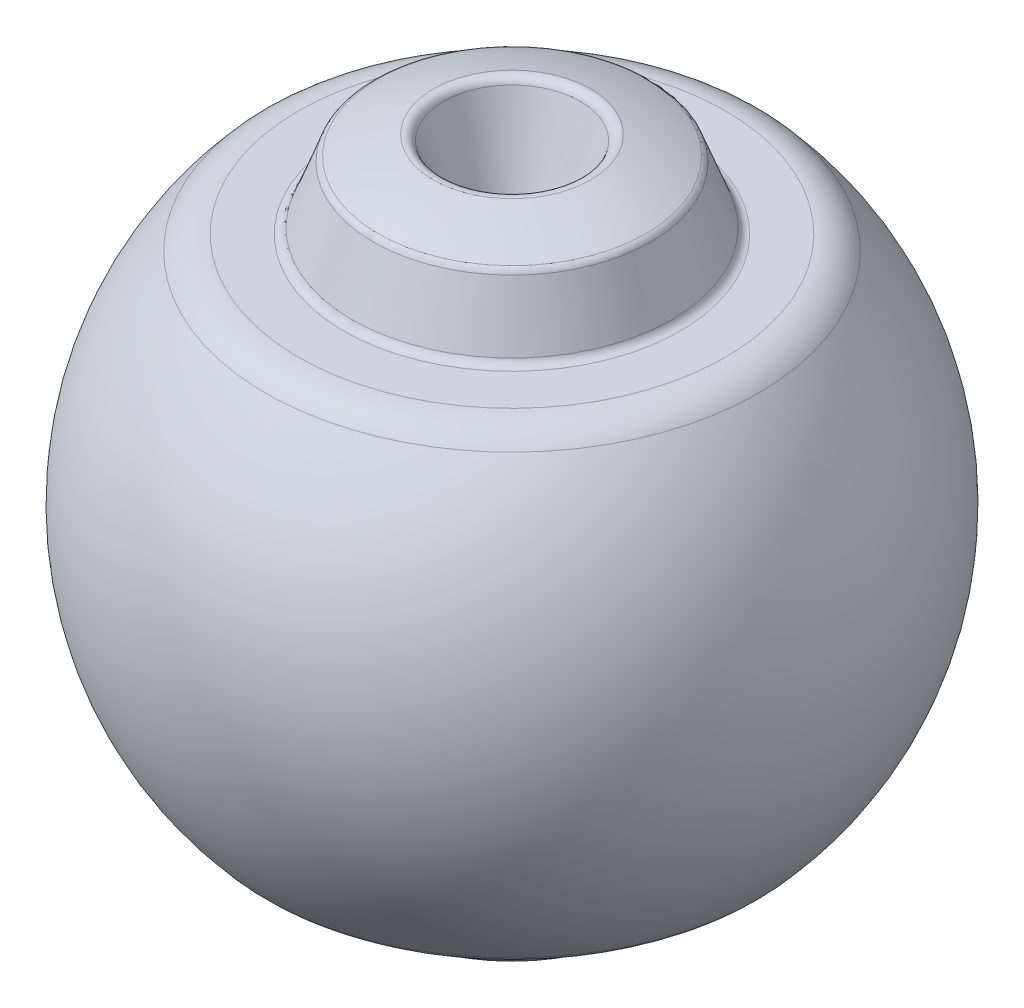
from build123d import *

# Parameters (mm, degrees)
FILLET1_R = 1
FILLET2_R = 5


with BuildPart() as part:
    # Sketch1 → Revolve1 (revolve)
    with BuildSketch(Plane.XY):
        with BuildLine():
            ThreePointArc((26.438477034, 26.594302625), (37.5, 0), (26.438477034, -26.594302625))
            Line((26.438477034, -26.594302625), (18.438477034, -26.594302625))
            Line((18.438477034, -26.594302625), (15.632766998, -34.08616429))
            ThreePointArc((15.632766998, -34.08616429), (11.926184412, -35.553004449), (8.084838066, -36.618101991))
            Line((8.084838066, -36.618101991), (4.436473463, -26.594302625))
            Line((4.436473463, -26.594302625), (0, -26.594302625))
            Line((0, -26.594302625), (0, 26.594302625))
            Line((0, 26.594302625), (4.436473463, 26.594302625))
            Line((4.436473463, 26.594302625), (8.084838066, 36.618101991))
            ThreePointArc((8.084838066, 36.618101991), (11.926184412, 35.553004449), (15.632766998, 34.08616429))
            Line((15.632766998, 34.08616429), (18.438477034, 26.594302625))
            Line((18.438477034, 26.594302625), (26.438477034, 26.594302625))
        make_face()
    revolve(axis=Axis((0, 26.594302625, 0), (0, -1, 0)))

    # Fillet1
    fillet1_edges = [part.edges().sort_by_distance(p)[0] for p in [
        (-18.438477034, -26.594302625, 0),
        (-15.632766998, -34.08616429, 0),
        (-8.084838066, -36.618101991, 0),
        (-4.436473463, -26.594302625, 0),
        (-4.436473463, 26.594302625, 0),
        (-8.084838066, 36.618101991, 0),
        (-15.632766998, 34.08616429, 0),
        (-18.438477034, 26.594302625, 0),
    ]]
    fillet(fillet1_edges, radius=FILLET1_R)

    # Fillet2
    fillet2_edges = [part.edges().sort_by_distance(p)[0] for p in [
        (-26.438477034, -26.594302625, 0),
        (-26.438477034, 26.594302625, 0),
    ]]
    fillet(fillet2_edges, radius=FILLET2_R)


solid = part.part
